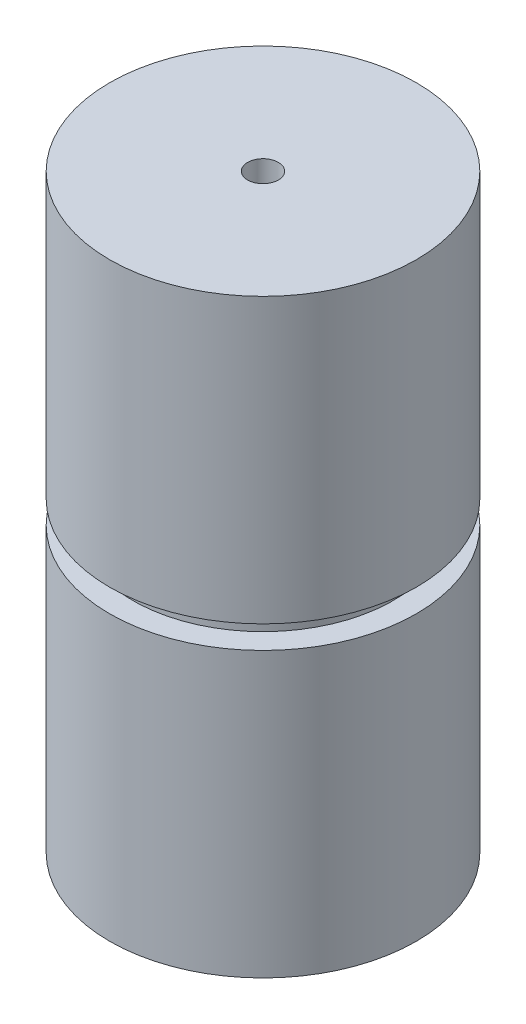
from build123d import *

# Parameters (mm, degrees)
SKETCH1_R          = 17
EXTRUDE1_DEPTH     = 3
SKETCH2_R          = 20
EXTRUDE2_DEPTH     = 37
EXTRUDE3_START     = 37
SKETCH3_R          = 20
EXTRUDE3_DEPTH     = 37
SKETCH4_R          = 2
CUT_EXTRUDE1_DEPTH = 16
CUT_EXTRUDE2_START = -16
SKETCH5_R          = 2
CUT_EXTRUDE2_DEPTH = 16


with BuildPart() as part:
    # Sketch1 → Extrude1 (new body)
    with BuildSketch(Plane(origin=(0, 0, 0), x_dir=(1, 0, 0), z_dir=(0, 1, 0))):
        with Locations(Location((0, 0, 0), (0, 0, 270))):
            Circle(SKETCH1_R)
    extrude(amount=EXTRUDE1_DEPTH)

    # Sketch2 → Extrude2 (add)
    with BuildSketch(Plane(origin=(0, 3, 0), x_dir=(-1, 0, 0), z_dir=(0, 1, 0))):
        with Locations(Location((0, 0, 0), (0, 0, 90))):
            Circle(SKETCH2_R)
    extrude(amount=EXTRUDE2_DEPTH)

    # Sketch3 → Extrude3 (add)
    with BuildSketch(Plane.XZ.offset(EXTRUDE3_START)):
        with Locations(Location((0, 0, 0), (0, 0, 90))):
            Circle(SKETCH3_R)
    extrude(amount=-EXTRUDE3_DEPTH)

    # Sketch4 → Cut-Extrude1 (cut)
    with BuildSketch(Plane(origin=(0, 40, 0), x_dir=(-1, 0, 0), z_dir=(0, 1, 0))):
        with Locations(Location((0, 0, 0), (0, 0, 90))):
            Circle(SKETCH4_R)
    extrude(amount=-CUT_EXTRUDE1_DEPTH, mode=Mode.SUBTRACT)

    # Sketch5 → Cut-Extrude2 (cut)
    with BuildSketch(Plane.XZ.offset(37).offset(CUT_EXTRUDE2_START)):
        with Locations(Location((0, 0, 0), (0, 0, 90))):
            Circle(SKETCH5_R)
    extrude(amount=CUT_EXTRUDE2_DEPTH, mode=Mode.SUBTRACT)


solid = part.part
